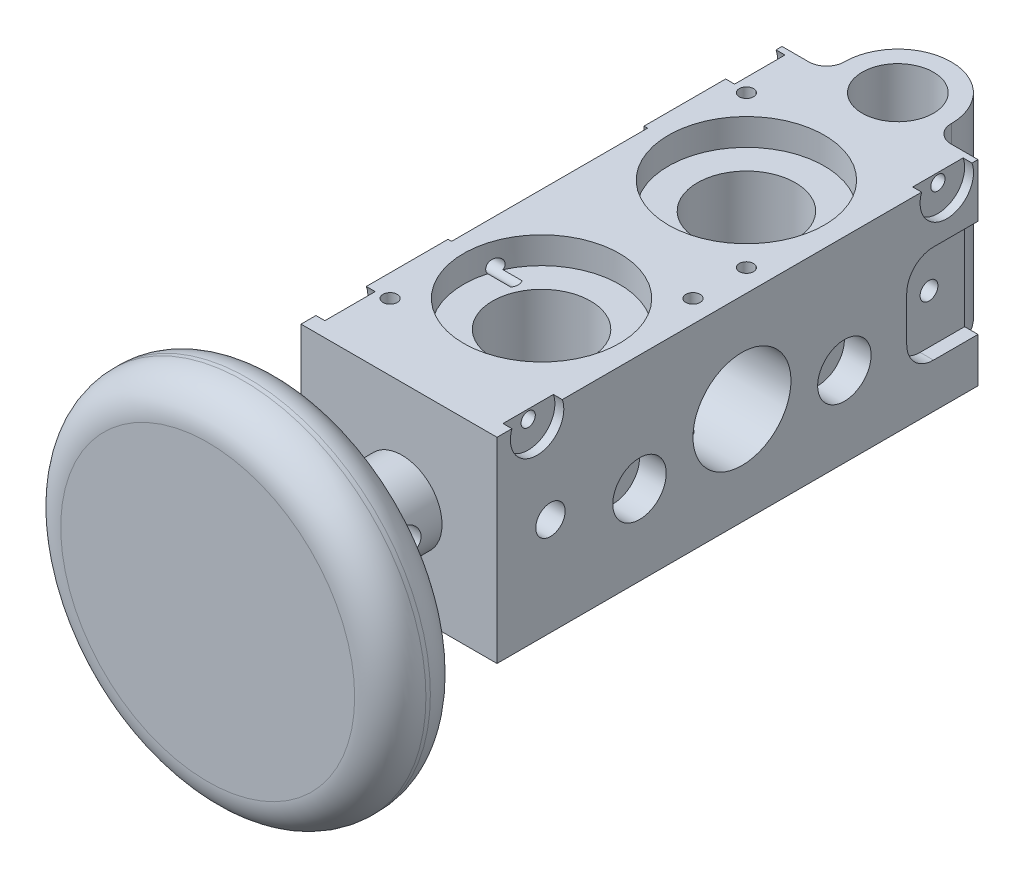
from build123d import *

# Parameters (mm, degrees)
ESQUISSE1_W                      = 22
ESQUISSE1_H                      = 22
EXTRUSION1_DEPTH                 = 54
ESQUISSE2_R                      = 4.5
EXTRUSION2_DEPTH                 = 13
ESQUISSE3_R                      = 20.5
EXTRUSION3_DEPTH                 = 8.5
CONG_1_R                         = 4
TROU_TARAUD_M4X0_71_D            = 3.3
TROU_TARAUD_M4X0_72_D            = 3.3
TROU_TARAUD_M4X0_73_D            = 3.3
TROU_TARAUD_M4X0_73_DEPTH        = 10.1
TROU_TARAUD_M4X0_73_TIP          = 0.991420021
TROU_TARAUD_M4X0_74_D            = 3.3
TROU_TARAUD_M4X0_74_DEPTH        = 10.1
TROU_TARAUD_M4X0_74_TIP          = 0.991420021
ESQUISSE15_R                     = 6
EXTRUSION4_DEPTH                 = 22
CONG_2_R                         = 2
ESQUISSE16_R                     = 4
ENL_V_MAT_EXTRU_1_DEPTH          = 88.394476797
ESQUISSE22_R                     = 8.75
ENL_V_MAT_EXTRU_5_DEPTH          = 3
ESQUISSE17_R                     = 8.75
ENL_V_MAT_EXTRU_2_DEPTH          = 3
ESQUISSE18_R                     = 5.5
ENL_V_MAT_EXTRU_3_DEPTH          = 87.866389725
ESQUISSE19_R                     = 3
ENL_V_MAT_EXTRU_4_DEPTH          = 3
TROU_TARAUD_M2X0_42_REACH        = 88.359
TROU_TARAUD_M2X0_42_BORE_R       = 0.8
R_P_TITION_LIN_AIRE1_COUNT       = 2
R_P_TITION_LIN_AIRE1_PITCH       = 23
ESQUISSE29_R                     = 3
ENL_V_MAT_EXTRU_13_DEPTH         = 3
R_P_TITION_LIN_AIRE2_COUNT       = 2
R_P_TITION_LIN_AIRE2_PITCH       = 7
TROU_TARAUD_M2X0_43_D            = 1.6
TROU_TARAUD_M2X0_43_DEPTH        = 5.2
TROU_TARAUD_M2X0_43_TIP          = 0.480688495
TROU_TARAUD_M2X0_44_D            = 1.6
TROU_TARAUD_M2X0_44_DEPTH        = 5.2
TROU_TARAUD_M2X0_44_TIP          = 0.480688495
ESQUISSE32_R                     = 5.5
ENL_V_MAT_EXTRU_16_DEPTH         = 87.372929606
ESQUISSE37_W                     = 22
ESQUISSE37_H                     = 22
ENL_V_MAT_EXTRU_17_DEPTH         = 0.4
ESQUISSE38_R                     = 3
ENL_V_MAT_EXTRU_18_DEPTH         = 1
R_P_TITION_LIN_AIRE3_COUNT       = 2
R_P_TITION_LIN_AIRE3_PITCH       = 23
ESQUISSE41_R                     = 3
ENL_V_MAT_EXTRU_19_DEPTH         = 1
R_P_TITION_LIN_AIRE4_COUNT       = 2
R_P_TITION_LIN_AIRE4_PITCH       = 46
SYM_TRIE1_COPY_1_SKETCH_R        = 3
SYM_TRIE1_COPY_1_DEPTH           = 1
ENL_V_MAT_EXTRU_20_DEPTH         = 1.5
ENL_V_MAT_EXTRU_21_DEPTH         = 1.5
TROU_TARAUD_M2X0_412_D           = 1.6
TROU_TARAUD_M2X0_412_DEPTH       = 7.2
TROU_TARAUD_M2X0_412_CBORE_D     = 2
TROU_TARAUD_M2X0_412_CBORE_DEPTH = 6
TROU_TARAUD_M2X0_412_TIP         = 0.480688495


with BuildPart() as part:
    # Esquisse1 → Extrusion1 (new body)
    with BuildSketch(Plane.XY):
        with Locations((-11, 11)):
            Rectangle(ESQUISSE1_W, ESQUISSE1_H)
    extrude(amount=EXTRUSION1_DEPTH)

    # Esquisse2 → Extrusion2 (add)
    with BuildSketch(Plane.XY.offset(54)):
        with Locations(Location((-10.673033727, 10.427809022, 0), (0, 0, 180))):
            Circle(ESQUISSE2_R)
    extrude(amount=EXTRUSION2_DEPTH)

    # Esquisse3 → Extrusion3 (add)
    with BuildSketch(Plane.XY.offset(67)):
        with Locations((-10.979263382, 10.266874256)):
            Circle(ESQUISSE3_R)
    extrude(amount=EXTRUSION3_DEPTH)

    # Cong_1
    cong_1_edges = [part.edges().sort_by_distance(p)[0] for p in [
        (-31.479263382, 10.266874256, 67),
        (-31.479263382, 10.266874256, 75.5),
    ]]
    fillet(cong_1_edges, radius=CONG_1_R)

    # Trou taraud_ M4x0.71 (through all)
    with Locations(Plane.XZ):
        with Locations((-10.673033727, 62.5)):
            Hole(TROU_TARAUD_M4X0_71_D / 2)

    # Trou taraud_ M4x0.72 (through all)
    with Locations(Plane(origin=(0, 0, 0), x_dir=(0, 0, -1), z_dir=(1, 0, 0))):
        with Locations((-58, 10.427809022)):
            Hole(TROU_TARAUD_M4X0_72_D / 2)

    # Trou taraud_ M4x0.73
    with Locations(Plane(origin=(0, 0, 0), x_dir=(0, 0, -1), z_dir=(1, 0, 0))):
        with Locations((-48, 11)):
            Hole(TROU_TARAUD_M4X0_73_D / 2, depth=TROU_TARAUD_M4X0_73_DEPTH)
            with Locations((0, 0, -(TROU_TARAUD_M4X0_73_DEPTH + TROU_TARAUD_M4X0_73_TIP / 2))):  # 118° drill point
                Cone(0, TROU_TARAUD_M4X0_73_D / 2, TROU_TARAUD_M4X0_73_TIP, mode=Mode.SUBTRACT)

    # Trou taraud_ M4x0.74
    with Locations(Plane.XZ):
        with Locations((-11, 51)):
            Hole(TROU_TARAUD_M4X0_74_D / 2, depth=TROU_TARAUD_M4X0_74_DEPTH)
            with Locations((0, 0, -(TROU_TARAUD_M4X0_74_DEPTH + TROU_TARAUD_M4X0_74_TIP / 2))):  # 118° drill point
                Cone(0, TROU_TARAUD_M4X0_74_D / 2, TROU_TARAUD_M4X0_74_TIP, mode=Mode.SUBTRACT)

    # Esquisse15 → Extrusion4 (add)
    with BuildSketch(Plane.XZ):
        with Locations((-11, -2)):
            Circle(ESQUISSE15_R)
    extrude(amount=-EXTRUSION4_DEPTH)

    # Cong_2
    cong_2_edges = [part.edges().sort_by_distance(p)[0] for p in [
        (-5.343145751, 11, 0),
        (-16.656854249, 11, 0),
    ]]
    fillet(cong_2_edges, radius=CONG_2_R)

    # Esquisse16 → Enl_v. mat.-Extru.1 (cut, through all)
    with BuildSketch(Plane.XZ):
        with Locations((-11, -2)):
            Circle(ESQUISSE16_R)
    extrude(amount=-ENL_V_MAT_EXTRU_1_DEPTH, mode=Mode.SUBTRACT)

    # Esquisse22 → Enl_v. mat.-Extru.5 (cut)
    with BuildSketch(Plane.ZY.offset(22)):
        with Locations(Location((26.5, 11, 0), (0, 0, 270))):
            Circle(ESQUISSE22_R)
    extrude(amount=-ENL_V_MAT_EXTRU_5_DEPTH, mode=Mode.SUBTRACT)

    # Esquisse17 → Enl_v. mat.-Extru.2 (cut)
    with BuildSketch(Plane(origin=(0, 22, 0), x_dir=(-1, 0, 0), z_dir=(0, 1, 0))):
        with Locations(Location((11, 38, 0), (0, 0, 90))):
            Circle(ESQUISSE17_R)
    enl_v_mat_extru_2 = extrude(amount=-ENL_V_MAT_EXTRU_2_DEPTH, mode=Mode.SUBTRACT)

    # Esquisse18 → Enl_v. mat.-Extru.3 (cut, through all)
    with BuildSketch(Plane(origin=(0, 19, 0), x_dir=(-1, 0, 0), z_dir=(0, 1, 0))):
        with Locations(Location((11, 38, 0), (0, 0, 90))):
            Circle(ESQUISSE18_R)
    enl_v_mat_extru_3 = extrude(amount=-ENL_V_MAT_EXTRU_3_DEPTH, mode=Mode.SUBTRACT)

    # Esquisse19 → Enl_v. mat.-Extru.4 (cut)
    with BuildSketch(Plane(origin=(0, 0, 0), x_dir=(0, 0, -1), z_dir=(1, 0, 0))):
        with Locations((-38, 9)):
            Circle(ESQUISSE19_R)
    enl_v_mat_extru_4 = extrude(amount=-ENL_V_MAT_EXTRU_4_DEPTH, mode=Mode.SUBTRACT)

    # Trou taraud_ M2x0.42 bore → Trou taraud_ M2x0.42 (cut, up to next)
    with BuildSketch(Plane(origin=(-3, 0, 0), x_dir=(0, 0, -1), z_dir=(1, 0, 0)), mode=Mode.PRIVATE) as trou_taraud_m2x0_42_sk1:
        with Locations((-38, 9)):
            Circle(TROU_TARAUD_M2X0_42_BORE_R)
    trou_taraud_m2x0_42_tool1 = extrude(trou_taraud_m2x0_42_sk1.sketch, amount=-TROU_TARAUD_M2X0_42_REACH, mode=Mode.PRIVATE) & part.part
    trou_taraud_m2x0_42 = trou_taraud_m2x0_42_tool1.solids().sort_by_distance((-3, 9, 38))[0]
    add(trou_taraud_m2x0_42, mode=Mode.SUBTRACT)

    # R_p_tition lin_aire1: Enl_v. mat.-Extru.2, Enl_v. mat.-Extru.3, Enl_v. mat.-Extru.4, Trou taraud_ M2x0.42 ×2
    with Locations(*[(0, 0, -i * R_P_TITION_LIN_AIRE1_PITCH) for i in range(1, R_P_TITION_LIN_AIRE1_COUNT)]):
        add(enl_v_mat_extru_2, mode=Mode.SUBTRACT)
        add(enl_v_mat_extru_3, mode=Mode.SUBTRACT)
        add(enl_v_mat_extru_4, mode=Mode.SUBTRACT)
        add(trou_taraud_m2x0_42, mode=Mode.SUBTRACT)

    # Esquisse29 → Enl_v. mat.-Extru.13 (cut)
    with BuildSketch(Plane.XZ):
        with Locations((-6.5, 26.5)):
            Circle(ESQUISSE29_R)
    enl_v_mat_extru_13 = extrude(amount=-ENL_V_MAT_EXTRU_13_DEPTH, mode=Mode.SUBTRACT)

    # Esquisse30 → Trou taraud_ M2x0.41 (revolve, cut)
    with BuildSketch(Plane(origin=(-6.5, 3, 26.5), x_dir=(0, 0, -1), z_dir=(1, 0, 0))):
        Polygon((0, 0), (0, 5.680688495), (0.8, 5.2), (0.8, 0), align=None)
    trou_taraud_m2x0_41 = revolve(axis=Axis((-6.5, -3.35, 26.5), (0, 1, 0)), mode=Mode.SUBTRACT)

    # R_p_tition lin_aire2: Enl_v. mat.-Extru.13, Trou taraud_ M2x0.41 ×2
    with Locations(*[(-i * R_P_TITION_LIN_AIRE2_PITCH, 0, 0) for i in range(1, R_P_TITION_LIN_AIRE2_COUNT)]):
        add(enl_v_mat_extru_13, mode=Mode.SUBTRACT)
        add(trou_taraud_m2x0_41, mode=Mode.SUBTRACT)

    # Trou taraud_ M2x0.43
    with Locations(Plane(origin=(0, 22, 0), x_dir=(-1, 0, 0), z_dir=(0, 1, 0))):
        with Locations((19.5, 6.5), (2.5, 23.5), (2.5, 29.5), (19.5, 46.5)):
            Hole(TROU_TARAUD_M2X0_43_D / 2, depth=TROU_TARAUD_M2X0_43_DEPTH)
            with Locations((0, 0, -(TROU_TARAUD_M2X0_43_DEPTH + TROU_TARAUD_M2X0_43_TIP / 2))):  # 118° drill point
                Cone(0, TROU_TARAUD_M2X0_43_D / 2, TROU_TARAUD_M2X0_43_TIP, mode=Mode.SUBTRACT)

    # Trou taraud_ M2x0.44
    with Locations(Plane.ZY.offset(22)):
        with Locations((35, 19.5), (18, 2.5)):
            Hole(TROU_TARAUD_M2X0_44_D / 2, depth=TROU_TARAUD_M2X0_44_DEPTH)
            with Locations((0, 0, -(TROU_TARAUD_M2X0_44_DEPTH + TROU_TARAUD_M2X0_44_TIP / 2))):  # 118° drill point
                Cone(0, TROU_TARAUD_M2X0_44_D / 2, TROU_TARAUD_M2X0_44_TIP, mode=Mode.SUBTRACT)

    # Esquisse32 → Enl_v. mat.-Extru.16 (cut, through all)
    with BuildSketch(Plane.ZY.offset(19)):
        with Locations(Location((26.5, 11, 0), (0, 0, 270))):
            Circle(ESQUISSE32_R)
    extrude(amount=-ENL_V_MAT_EXTRU_16_DEPTH, mode=Mode.SUBTRACT)

    # Esquisse37 → Enl_v. mat.-Extru.17 (cut)
    with BuildSketch(Plane.ZY.offset(22)):
        with Locations((26.5, 11)):
            Rectangle(ESQUISSE37_W, ESQUISSE37_H)
    extrude(amount=-ENL_V_MAT_EXTRU_17_DEPTH, mode=Mode.SUBTRACT)

    # Esquisse38 → Enl_v. mat.-Extru.18 (cut)
    with BuildSketch(Plane.XZ):
        with Locations((-21, 38)):
            Circle(ESQUISSE38_R)
    enl_v_mat_extru_18 = extrude(amount=-ENL_V_MAT_EXTRU_18_DEPTH, mode=Mode.SUBTRACT)

    # Esquisse39 → Trou taraud_ M2x0.45 (revolve, cut)
    with BuildSketch(Plane(origin=(-21, 1, 38), x_dir=(0, 0, -1), z_dir=(1, 0, 0))):
        Polygon((0, 0), (0, 5.680688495), (0.8, 5.2), (0.8, 0), align=None)
    trou_taraud_m2x0_45 = revolve(axis=Axis((-21, -5.35, 38), (0, 1, 0)), mode=Mode.SUBTRACT)

    # R_p_tition lin_aire3: Enl_v. mat.-Extru.18, Trou taraud_ M2x0.45 ×2
    with Locations(*[(0, 0, -i * R_P_TITION_LIN_AIRE3_PITCH) for i in range(1, R_P_TITION_LIN_AIRE3_COUNT)]):
        add(enl_v_mat_extru_18, mode=Mode.SUBTRACT)
        add(trou_taraud_m2x0_45, mode=Mode.SUBTRACT)

    # Esquisse41 → Enl_v. mat.-Extru.19 (cut)
    with BuildSketch(Plane.ZY.offset(22)):
        with Locations((3.5, 21)):
            Circle(ESQUISSE41_R)
    enl_v_mat_extru_19 = extrude(amount=-ENL_V_MAT_EXTRU_19_DEPTH, mode=Mode.SUBTRACT)

    # Esquisse42 → Trou taraud_ M2x0.46 (revolve, cut)
    with BuildSketch(Plane(origin=(-21, 21, 3.5), x_dir=(0, 0, 1), z_dir=(0, 1, 0))):
        Polygon((0, 0), (0, 5.680688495), (0.8, 5.2), (0.8, 0), align=None)
    trou_taraud_m2x0_46 = revolve(axis=Axis((-27.35, 21, 3.5), (1, 0, 0)), mode=Mode.SUBTRACT)

    # R_p_tition lin_aire4: Enl_v. mat.-Extru.19, Trou taraud_ M2x0.46 ×2
    with Locations(*[(0, 0, i * R_P_TITION_LIN_AIRE4_PITCH) for i in range(1, R_P_TITION_LIN_AIRE4_COUNT)]):
        add(enl_v_mat_extru_19, mode=Mode.SUBTRACT)
        add(trou_taraud_m2x0_46, mode=Mode.SUBTRACT)

    # Sym_trie1: Enl_v. mat.-Extru.19, Trou taraud_ M2x0.46 across plane
    add(enl_v_mat_extru_19.mirror(Plane(origin=(-11, 0, 0), x_dir=(0, 0, 1), z_dir=(1, 0, 0))), mode=Mode.SUBTRACT)
    add(trou_taraud_m2x0_46.mirror(Plane(origin=(-11, 0, 0), x_dir=(0, 0, 1), z_dir=(1, 0, 0))), mode=Mode.SUBTRACT)

    # Sym_trie1 copy 1 sketch → Sym_trie1 copy 1 (cut)
    with BuildSketch(Plane(origin=(0, 0, 46), x_dir=(0, 0, 1), z_dir=(1, 0, 0))):
        with Locations((3.5, -21)):
            Circle(SYM_TRIE1_COPY_1_SKETCH_R)
    extrude(amount=-SYM_TRIE1_COPY_1_DEPTH, mode=Mode.SUBTRACT)

    # Sym_trie1 copy 2 sketch → Sym_trie1 copy 2 (revolve, cut)
    with BuildSketch(Plane(origin=(-1, 21, 49.5), x_dir=(0, 0, 1), z_dir=(0, 1, 0))):
        Polygon((0, 0), (0, -5.680688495), (0.8, -5.2), (0.8, 0), align=None)
    revolve(axis=Axis((5.35, 21, 49.5), (1, 0, 0)), mode=Mode.SUBTRACT)

    # Esquisse44 → Enl_v. mat.-Extru.20 (cut)
    with BuildSketch(Plane(origin=(0, 0, 0), x_dir=(0, 0, -1), z_dir=(1, 0, 0))):
        with BuildLine():
            Line((-5, 16), (0, 16))
            Line((0, 16), (0, 5))
            Line((0, 5), (-5, 5))
            ThreePointArc((-5, 5), (-7.121320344, 5.878679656), (-8, 8))
            Line((-8, 8), (-8, 13))
            ThreePointArc((-8, 13), (-7.121320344, 15.121320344), (-5, 16))
        make_face()
    extrude(amount=-ENL_V_MAT_EXTRU_20_DEPTH, mode=Mode.SUBTRACT)

    # Esquisse46 → Enl_v. mat.-Extru.21 (cut)
    with BuildSketch(Plane.ZY.offset(22)):
        with BuildLine():
            Line((0, 6), (0, 17))
            Line((0, 17), (5, 17))
            ThreePointArc((5, 17), (7.121320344, 16.121320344), (8, 14))
            Line((8, 14), (8, 9))
            ThreePointArc((8, 9), (7.121320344, 6.878679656), (5, 6))
            Line((5, 6), (0, 6))
        make_face()
    extrude(amount=-ENL_V_MAT_EXTRU_21_DEPTH, mode=Mode.SUBTRACT)

    # Esquisse66 → Trou taraud_ M2x0.410 (revolve, cut)
    with BuildSketch(Plane(origin=(-20.5, 11.5, 4), x_dir=(0, 0, 1), z_dir=(0, 1, 0))):
        Polygon((0, 0), (0, 5.980688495), (0.8, 5.5), (0.8, 6), (1, 6), (1, 0), align=None)
    revolve(axis=Axis((-26.85, 11.5, 4), (1, 0, 0)), mode=Mode.SUBTRACT)

    # Trou taraud_ M2x0.412
    with Locations(Plane(origin=(-1.5, 0, 0), x_dir=(0, 0, -1), z_dir=(1, 0, 0))):
        with Locations((-4, 10.5)):
            CounterBoreHole(TROU_TARAUD_M2X0_412_D / 2, TROU_TARAUD_M2X0_412_CBORE_D / 2, TROU_TARAUD_M2X0_412_CBORE_DEPTH, depth=TROU_TARAUD_M2X0_412_DEPTH)
            with Locations((0, 0, -(TROU_TARAUD_M2X0_412_DEPTH + TROU_TARAUD_M2X0_412_TIP / 2))):  # 118° drill point
                Cone(0, TROU_TARAUD_M2X0_412_D / 2, TROU_TARAUD_M2X0_412_TIP, mode=Mode.SUBTRACT)


solid = part.part
